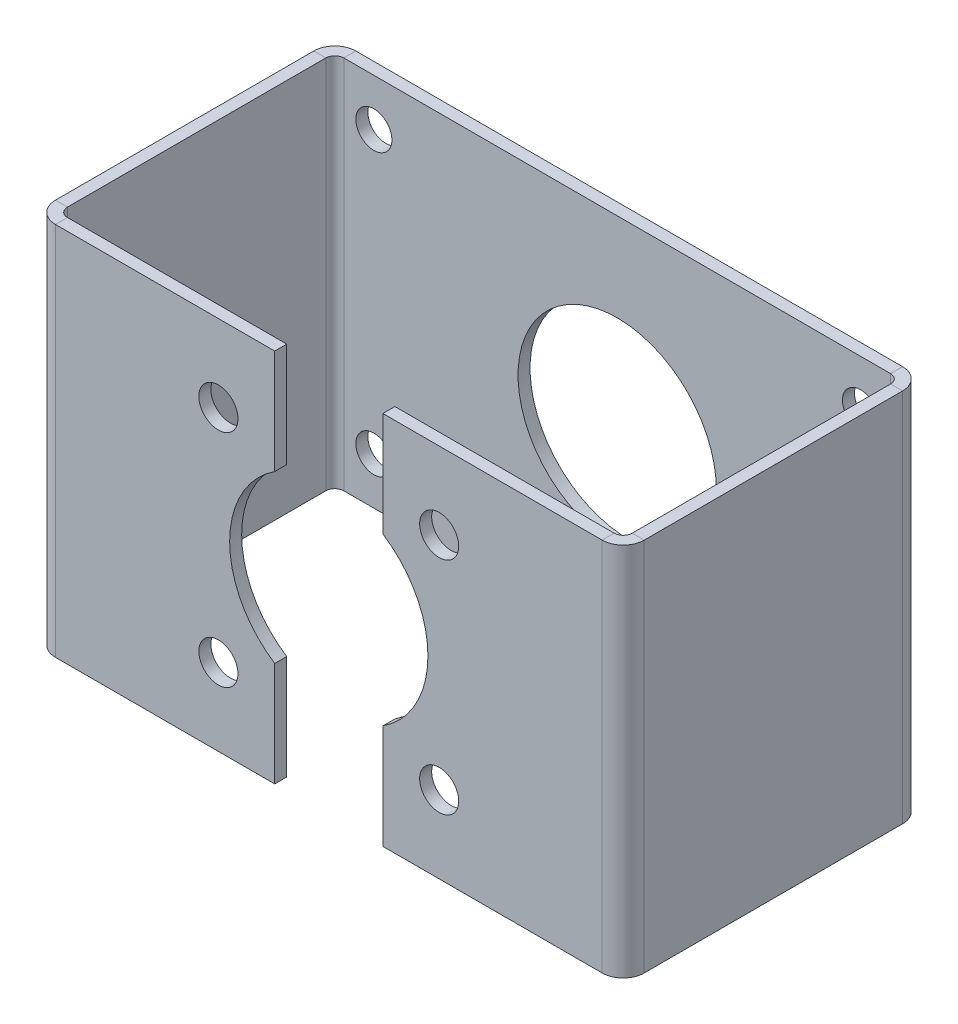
ISO-10303-21;
HEADER;
FILE_DESCRIPTION(('STEP AP214'),'2;1');
FILE_NAME('part.step','',(''),(''),'','','');
FILE_SCHEMA(('AUTOMOTIVE_DESIGN { 1 0 10303 214 1 1 1 1 }'));
ENDSEC;
DATA;
#1=APPLICATION_CONTEXT('core data for automotive mechanical design processes');
#2=APPLICATION_PROTOCOL_DEFINITION('international standard','automotive_design',2000,#1);
#3=PRODUCT_CONTEXT('',#1,'mechanical');
#4=PRODUCT('Part','Part','',(#3));
#5=PRODUCT_RELATED_PRODUCT_CATEGORY('part','',(#4));
#6=PRODUCT_DEFINITION_FORMATION('','',#4);
#7=PRODUCT_DEFINITION_CONTEXT('part definition',#1,'design');
#8=PRODUCT_DEFINITION('design','',#6,#7);
#9=PRODUCT_DEFINITION_SHAPE('','',#8);
#10=(LENGTH_UNIT() NAMED_UNIT(*) SI_UNIT(.MILLI.,.METRE.));
#11=(NAMED_UNIT(*) PLANE_ANGLE_UNIT() SI_UNIT($,.RADIAN.));
#12=(NAMED_UNIT(*) SI_UNIT($,.STERADIAN.) SOLID_ANGLE_UNIT());
#13=UNCERTAINTY_MEASURE_WITH_UNIT(LENGTH_MEASURE(1.E-05),#10,'distance_accuracy_value','');
#14=(GEOMETRIC_REPRESENTATION_CONTEXT(3) GLOBAL_UNCERTAINTY_ASSIGNED_CONTEXT((#13)) GLOBAL_UNIT_ASSIGNED_CONTEXT((#10,
#11,#12)) REPRESENTATION_CONTEXT('',''));
#15=CARTESIAN_POINT('',(0.,0.,0.));
#16=DIRECTION('',(0.,0.,1.));
#17=DIRECTION('',(1.,0.,0.));
#18=AXIS2_PLACEMENT_3D('',#15,#16,#17);
#19=CARTESIAN_POINT('',(-149.225000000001,-99.06,158.75));
#20=DIRECTION('',(0.,0.,1.));
#21=DIRECTION('',(1.,0.,0.));
#22=AXIS2_PLACEMENT_3D('',#19,#20,#21);
#23=PLANE('',#22);
#24=CARTESIAN_POINT('',(-58.3363094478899,58.3363094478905,158.750000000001));
#25=DIRECTION('',(0.,0.,1.));
#26=DIRECTION('',(1.,0.,0.));
#27=AXIS2_PLACEMENT_3D('',#24,#25,#26);
#28=CIRCLE('',#27,10.3251);
#29=CARTESIAN_POINT('',(-48.0112094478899,58.3363094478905,158.750000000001));
#30=VERTEX_POINT('',#29);
#31=EDGE_CURVE('E615',#30,#30,#28,.T.);
#32=ORIENTED_EDGE('',*,*,#31,.F.);
#33=EDGE_LOOP('',(#32));
#34=FACE_BOUND('',#33,.T.);
#35=CARTESIAN_POINT('',(-58.3363179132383,-58.3363009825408,158.750000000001));
#36=DIRECTION('',(0.,0.,1.));
#37=DIRECTION('',(1.,0.,0.));
#38=AXIS2_PLACEMENT_3D('',#35,#36,#37);
#39=CIRCLE('',#38,10.3251);
#40=CARTESIAN_POINT('',(-48.0112179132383,-58.3363009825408,158.750000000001));
#41=VERTEX_POINT('',#40);
#42=EDGE_CURVE('E633',#41,#41,#39,.T.);
#43=ORIENTED_EDGE('',*,*,#42,.F.);
#44=EDGE_LOOP('',(#43));
#45=FACE_BOUND('',#44,.T.);
#46=DIRECTION('',(0.,-1.,0.));
#47=VECTOR('',#46,1.);
#48=CARTESIAN_POINT('',(-28.5750000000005,-99.06,158.750000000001));
#49=LINE('',#48,#47);
#50=CARTESIAN_POINT('',(-28.5750000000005,-99.06,158.750000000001));
#51=VERTEX_POINT('',#50);
#52=CARTESIAN_POINT('',(-28.5750000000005,-43.908080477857,158.750000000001));
#53=VERTEX_POINT('',#52);
#54=EDGE_CURVE('E470',#51,#53,#49,.F.);
#55=ORIENTED_EDGE('',*,*,#54,.T.);
#56=CARTESIAN_POINT('',(0.,0.,158.750000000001));
#57=DIRECTION('',(0.,0.,1.));
#58=DIRECTION('',(1.,0.,0.));
#59=AXIS2_PLACEMENT_3D('',#56,#57,#58);
#60=CIRCLE('',#59,52.3875);
#61=CARTESIAN_POINT('',(-28.5750000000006,43.9080804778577,158.750000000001));
#62=VERTEX_POINT('',#61);
#63=EDGE_CURVE('E275',#62,#53,#60,.T.);
#64=ORIENTED_EDGE('',*,*,#63,.F.);
#65=CARTESIAN_POINT('',(-28.5750000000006,99.0600000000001,158.750000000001));
#66=VERTEX_POINT('',#65);
#67=EDGE_CURVE('E471',#62,#66,#49,.F.);
#68=ORIENTED_EDGE('',*,*,#67,.T.);
#69=DIRECTION('',(1.,0.,0.));
#70=VECTOR('',#69,1.);
#71=CARTESIAN_POINT('',(-149.225000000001,99.06,158.75));
#72=LINE('',#71,#70);
#73=CARTESIAN_POINT('',(-144.462500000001,99.06,158.75));
#74=VERTEX_POINT('',#73);
#75=EDGE_CURVE('E467',#66,#74,#72,.F.);
#76=ORIENTED_EDGE('',*,*,#75,.T.);
#77=DIRECTION('',(0.,-1.,0.));
#78=VECTOR('',#77,1.);
#79=CARTESIAN_POINT('',(-144.4625,-99.06,158.75));
#80=LINE('',#79,#78);
#81=CARTESIAN_POINT('',(-144.4625,-99.06,158.75));
#82=VERTEX_POINT('',#81);
#83=EDGE_CURVE('E304',#74,#82,#80,.T.);
#84=ORIENTED_EDGE('',*,*,#83,.T.);
#85=DIRECTION('',(-1.,0.,0.));
#86=VECTOR('',#85,1.);
#87=CARTESIAN_POINT('',(-149.225000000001,-99.06,158.75));
#88=LINE('',#87,#86);
#89=EDGE_CURVE('E298',#82,#51,#88,.F.);
#90=ORIENTED_EDGE('',*,*,#89,.T.);
#91=EDGE_LOOP('',(#55,#64,#68,#76,#84,#90));
#92=FACE_BOUND('',#91,.T.);
#93=ADVANCED_FACE('F112',(#34,#45,#92),#23,.T.);
#94=CARTESIAN_POINT('',(-149.225,-99.06,152.4));
#95=DIRECTION('',(0.,0.,1.));
#96=DIRECTION('',(1.,0.,0.));
#97=AXIS2_PLACEMENT_3D('',#94,#95,#96);
#98=PLANE('',#97);
#99=CARTESIAN_POINT('',(-58.3363094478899,58.3363094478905,152.400000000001));
#100=DIRECTION('',(0.,0.,1.));
#101=DIRECTION('',(1.,0.,0.));
#102=AXIS2_PLACEMENT_3D('',#99,#100,#101);
#103=CIRCLE('',#102,10.3251);
#104=CARTESIAN_POINT('',(-48.0112094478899,58.3363094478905,152.400000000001));
#105=VERTEX_POINT('',#104);
#106=EDGE_CURVE('E582',#105,#105,#103,.F.);
#107=ORIENTED_EDGE('',*,*,#106,.F.);
#108=EDGE_LOOP('',(#107));
#109=FACE_BOUND('',#108,.T.);
#110=CARTESIAN_POINT('',(-58.3363179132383,-58.3363009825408,152.400000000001));
#111=DIRECTION('',(0.,0.,1.));
#112=DIRECTION('',(1.,0.,0.));
#113=AXIS2_PLACEMENT_3D('',#110,#111,#112);
#114=CIRCLE('',#113,10.3251);
#115=CARTESIAN_POINT('',(-48.0112179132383,-58.3363009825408,152.400000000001));
#116=VERTEX_POINT('',#115);
#117=EDGE_CURVE('E630',#116,#116,#114,.F.);
#118=ORIENTED_EDGE('',*,*,#117,.F.);
#119=EDGE_LOOP('',(#118));
#120=FACE_BOUND('',#119,.T.);
#121=CARTESIAN_POINT('',(0.,0.,152.400000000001));
#122=DIRECTION('',(0.,0.,1.));
#123=DIRECTION('',(1.,0.,0.));
#124=AXIS2_PLACEMENT_3D('',#121,#122,#123);
#125=CIRCLE('',#124,52.3875);
#126=CARTESIAN_POINT('',(-28.5750000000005,43.9080804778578,152.400000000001));
#127=VERTEX_POINT('',#126);
#128=CARTESIAN_POINT('',(-28.5750000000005,-43.908080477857,152.400000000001));
#129=VERTEX_POINT('',#128);
#130=EDGE_CURVE('E129',#127,#129,#125,.T.);
#131=ORIENTED_EDGE('',*,*,#130,.T.);
#132=DIRECTION('',(0.,1.,0.));
#133=VECTOR('',#132,1.);
#134=CARTESIAN_POINT('',(-28.5750000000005,-99.06,152.400000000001));
#135=LINE('',#134,#133);
#136=CARTESIAN_POINT('',(-28.5750000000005,-99.06,152.400000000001));
#137=VERTEX_POINT('',#136);
#138=EDGE_CURVE('E287',#137,#129,#135,.T.);
#139=ORIENTED_EDGE('',*,*,#138,.F.);
#140=DIRECTION('',(1.,0.,0.));
#141=VECTOR('',#140,1.);
#142=CARTESIAN_POINT('',(-149.225,-99.06,152.4));
#143=LINE('',#142,#141);
#144=CARTESIAN_POINT('',(-144.462500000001,-99.06,152.4));
#145=VERTEX_POINT('',#144);
#146=EDGE_CURVE('E300',#145,#137,#143,.T.);
#147=ORIENTED_EDGE('',*,*,#146,.F.);
#148=DIRECTION('',(0.,1.,0.));
#149=VECTOR('',#148,1.);
#150=CARTESIAN_POINT('',(-144.462500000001,99.06,152.4));
#151=LINE('',#150,#149);
#152=CARTESIAN_POINT('',(-144.462500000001,99.06,152.4));
#153=VERTEX_POINT('',#152);
#154=EDGE_CURVE('E310',#153,#145,#151,.F.);
#155=ORIENTED_EDGE('',*,*,#154,.F.);
#156=DIRECTION('',(-1.,0.,0.));
#157=VECTOR('',#156,1.);
#158=CARTESIAN_POINT('',(-28.5750000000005,99.06,152.400000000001));
#159=LINE('',#158,#157);
#160=CARTESIAN_POINT('',(-28.5750000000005,99.06,152.400000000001));
#161=VERTEX_POINT('',#160);
#162=EDGE_CURVE('E295',#161,#153,#159,.T.);
#163=ORIENTED_EDGE('',*,*,#162,.F.);
#164=EDGE_CURVE('E289',#127,#161,#135,.T.);
#165=ORIENTED_EDGE('',*,*,#164,.F.);
#166=EDGE_LOOP('',(#131,#139,#147,#155,#163,#165));
#167=FACE_BOUND('',#166,.T.);
#168=ADVANCED_FACE('F285',(#109,#120,#167),#98,.F.);
#169=CARTESIAN_POINT('',(-28.5750000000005,-99.06,158.750000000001));
#170=DIRECTION('',(-1.,0.,0.));
#171=DIRECTION('',(0.,0.,1.));
#172=AXIS2_PLACEMENT_3D('',#169,#170,#171);
#173=PLANE('',#172);
#174=DIRECTION('',(0.,0.,1.));
#175=VECTOR('',#174,1.);
#176=CARTESIAN_POINT('',(-28.5750000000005,-43.908080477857,158.750000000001));
#177=LINE('',#176,#175);
#178=EDGE_CURVE('E272',#53,#129,#177,.F.);
#179=ORIENTED_EDGE('',*,*,#178,.F.);
#180=ORIENTED_EDGE('',*,*,#54,.F.);
#181=DIRECTION('',(0.,0.,-1.));
#182=VECTOR('',#181,1.);
#183=CARTESIAN_POINT('',(-28.5750000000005,-99.06,158.750000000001));
#184=LINE('',#183,#182);
#185=EDGE_CURVE('E294',#51,#137,#184,.T.);
#186=ORIENTED_EDGE('',*,*,#185,.T.);
#187=ORIENTED_EDGE('',*,*,#138,.T.);
#188=EDGE_LOOP('',(#179,#180,#186,#187));
#189=FACE_BOUND('',#188,.T.);
#190=ADVANCED_FACE('F292',(#189),#173,.F.);
#191=DIRECTION('',(0.,0.,1.));
#192=VECTOR('',#191,1.);
#193=CARTESIAN_POINT('',(-28.5750000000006,43.9080804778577,158.750000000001));
#194=LINE('',#193,#192);
#195=EDGE_CURVE('E280',#62,#127,#194,.F.);
#196=ORIENTED_EDGE('',*,*,#195,.T.);
#197=ORIENTED_EDGE('',*,*,#164,.T.);
#198=DIRECTION('',(0.,0.,-1.));
#199=VECTOR('',#198,1.);
#200=CARTESIAN_POINT('',(-28.5750000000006,99.06,158.750000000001));
#201=LINE('',#200,#199);
#202=EDGE_CURVE('E464',#66,#161,#201,.T.);
#203=ORIENTED_EDGE('',*,*,#202,.F.);
#204=ORIENTED_EDGE('',*,*,#67,.F.);
#205=EDGE_LOOP('',(#196,#197,#203,#204));
#206=FACE_BOUND('',#205,.T.);
#207=ADVANCED_FACE('F478',(#206),#173,.F.);
#208=CARTESIAN_POINT('',(149.225000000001,-99.06,158.75));
#209=DIRECTION('',(0.,0.,1.));
#210=DIRECTION('',(-1.,0.,0.));
#211=AXIS2_PLACEMENT_3D('',#208,#209,#210);
#212=PLANE('',#211);
#213=CARTESIAN_POINT('',(58.3363009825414,58.3363009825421,158.750000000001));
#214=DIRECTION('',(0.,0.,1.));
#215=DIRECTION('',(1.,0.,0.));
#216=AXIS2_PLACEMENT_3D('',#213,#214,#215);
#217=CIRCLE('',#216,10.3251);
#218=CARTESIAN_POINT('',(68.6614009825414,58.3363009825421,158.750000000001));
#219=VERTEX_POINT('',#218);
#220=EDGE_CURVE('E621',#219,#219,#217,.T.);
#221=ORIENTED_EDGE('',*,*,#220,.F.);
#222=EDGE_LOOP('',(#221));
#223=FACE_BOUND('',#222,.T.);
#224=CARTESIAN_POINT('',(58.3362925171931,-58.3363094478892,158.750000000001));
#225=DIRECTION('',(0.,0.,1.));
#226=DIRECTION('',(1.,0.,0.));
#227=AXIS2_PLACEMENT_3D('',#224,#225,#226);
#228=CIRCLE('',#227,10.3251);
#229=CARTESIAN_POINT('',(68.6613925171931,-58.3363094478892,158.750000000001));
#230=VERTEX_POINT('',#229);
#231=EDGE_CURVE('E627',#230,#230,#228,.T.);
#232=ORIENTED_EDGE('',*,*,#231,.F.);
#233=EDGE_LOOP('',(#232));
#234=FACE_BOUND('',#233,.T.);
#235=DIRECTION('',(0.,1.,0.));
#236=VECTOR('',#235,1.);
#237=CARTESIAN_POINT('',(28.5750000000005,-99.06,158.750000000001));
#238=LINE('',#237,#236);
#239=CARTESIAN_POINT('',(28.5750000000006,43.9080804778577,158.750000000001));
#240=VERTEX_POINT('',#239);
#241=CARTESIAN_POINT('',(28.5750000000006,99.06,158.750000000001));
#242=VERTEX_POINT('',#241);
#243=EDGE_CURVE('E602',#240,#242,#238,.T.);
#244=ORIENTED_EDGE('',*,*,#243,.F.);
#245=CARTESIAN_POINT('',(0.,0.,158.750000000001));
#246=DIRECTION('',(0.,0.,1.));
#247=DIRECTION('',(1.,0.,0.));
#248=AXIS2_PLACEMENT_3D('',#245,#246,#247);
#249=CIRCLE('',#248,52.3875);
#250=CARTESIAN_POINT('',(28.5750000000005,-43.908080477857,158.750000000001));
#251=VERTEX_POINT('',#250);
#252=EDGE_CURVE('E137',#251,#240,#249,.T.);
#253=ORIENTED_EDGE('',*,*,#252,.F.);
#254=CARTESIAN_POINT('',(28.5750000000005,-99.06,158.750000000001));
#255=VERTEX_POINT('',#254);
#256=EDGE_CURVE('E603',#255,#251,#238,.T.);
#257=ORIENTED_EDGE('',*,*,#256,.F.);
#258=DIRECTION('',(-1.,0.,0.));
#259=VECTOR('',#258,1.);
#260=CARTESIAN_POINT('',(149.225000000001,-99.06,158.75));
#261=LINE('',#260,#259);
#262=CARTESIAN_POINT('',(144.462500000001,-99.06,158.75));
#263=VERTEX_POINT('',#262);
#264=EDGE_CURVE('E606',#263,#255,#261,.T.);
#265=ORIENTED_EDGE('',*,*,#264,.F.);
#266=DIRECTION('',(0.,1.,0.));
#267=VECTOR('',#266,1.);
#268=CARTESIAN_POINT('',(144.4625,-99.06,158.75));
#269=LINE('',#268,#267);
#270=CARTESIAN_POINT('',(144.462500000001,99.06,158.75));
#271=VERTEX_POINT('',#270);
#272=EDGE_CURVE('E587',#263,#271,#269,.T.);
#273=ORIENTED_EDGE('',*,*,#272,.T.);
#274=DIRECTION('',(1.,0.,0.));
#275=VECTOR('',#274,1.);
#276=CARTESIAN_POINT('',(28.5750000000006,99.06,158.750000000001));
#277=LINE('',#276,#275);
#278=EDGE_CURVE('E599',#242,#271,#277,.T.);
#279=ORIENTED_EDGE('',*,*,#278,.F.);
#280=EDGE_LOOP('',(#244,#253,#257,#265,#273,#279));
#281=FACE_BOUND('',#280,.T.);
#282=ADVANCED_FACE('F672',(#223,#234,#281),#212,.T.);
#283=CARTESIAN_POINT('',(149.225,-99.06,152.4));
#284=DIRECTION('',(0.,0.,1.));
#285=DIRECTION('',(-1.,0.,0.));
#286=AXIS2_PLACEMENT_3D('',#283,#284,#285);
#287=PLANE('',#286);
#288=CARTESIAN_POINT('',(58.3363009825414,58.3363009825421,152.400000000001));
#289=DIRECTION('',(0.,0.,1.));
#290=DIRECTION('',(1.,0.,0.));
#291=AXIS2_PLACEMENT_3D('',#288,#289,#290);
#292=CIRCLE('',#291,10.3251);
#293=CARTESIAN_POINT('',(68.6614009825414,58.3363009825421,152.400000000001));
#294=VERTEX_POINT('',#293);
#295=EDGE_CURVE('E618',#294,#294,#292,.F.);
#296=ORIENTED_EDGE('',*,*,#295,.F.);
#297=EDGE_LOOP('',(#296));
#298=FACE_BOUND('',#297,.T.);
#299=CARTESIAN_POINT('',(58.3362925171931,-58.3363094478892,152.400000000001));
#300=DIRECTION('',(0.,0.,1.));
#301=DIRECTION('',(1.,0.,0.));
#302=AXIS2_PLACEMENT_3D('',#299,#300,#301);
#303=CIRCLE('',#302,10.3251);
#304=CARTESIAN_POINT('',(68.6613925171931,-58.3363094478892,152.400000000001));
#305=VERTEX_POINT('',#304);
#306=EDGE_CURVE('E624',#305,#305,#303,.F.);
#307=ORIENTED_EDGE('',*,*,#306,.F.);
#308=EDGE_LOOP('',(#307));
#309=FACE_BOUND('',#308,.T.);
#310=CARTESIAN_POINT('',(0.,0.,152.400000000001));
#311=DIRECTION('',(0.,0.,1.));
#312=DIRECTION('',(1.,0.,0.));
#313=AXIS2_PLACEMENT_3D('',#310,#311,#312);
#314=CIRCLE('',#313,52.3875);
#315=CARTESIAN_POINT('',(28.5750000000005,-43.908080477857,152.400000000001));
#316=VERTEX_POINT('',#315);
#317=CARTESIAN_POINT('',(28.5750000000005,43.9080804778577,152.400000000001));
#318=VERTEX_POINT('',#317);
#319=EDGE_CURVE('E640',#316,#318,#314,.T.);
#320=ORIENTED_EDGE('',*,*,#319,.T.);
#321=DIRECTION('',(0.,-1.,0.));
#322=VECTOR('',#321,1.);
#323=CARTESIAN_POINT('',(28.5750000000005,-99.06,152.400000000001));
#324=LINE('',#323,#322);
#325=CARTESIAN_POINT('',(28.5750000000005,99.0600000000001,152.400000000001));
#326=VERTEX_POINT('',#325);
#327=EDGE_CURVE('E593',#318,#326,#324,.F.);
#328=ORIENTED_EDGE('',*,*,#327,.T.);
#329=DIRECTION('',(-1.,0.,0.));
#330=VECTOR('',#329,1.);
#331=CARTESIAN_POINT('',(149.225000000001,99.06,152.4));
#332=LINE('',#331,#330);
#333=CARTESIAN_POINT('',(144.462500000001,99.06,152.4));
#334=VERTEX_POINT('',#333);
#335=EDGE_CURVE('E590',#326,#334,#332,.F.);
#336=ORIENTED_EDGE('',*,*,#335,.T.);
#337=DIRECTION('',(0.,-1.,0.));
#338=VECTOR('',#337,1.);
#339=CARTESIAN_POINT('',(144.4625,-99.06,152.4));
#340=LINE('',#339,#338);
#341=CARTESIAN_POINT('',(144.462500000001,-99.06,152.4));
#342=VERTEX_POINT('',#341);
#343=EDGE_CURVE('E581',#342,#334,#340,.F.);
#344=ORIENTED_EDGE('',*,*,#343,.F.);
#345=DIRECTION('',(1.,0.,0.));
#346=VECTOR('',#345,1.);
#347=CARTESIAN_POINT('',(149.225,-99.06,152.4));
#348=LINE('',#347,#346);
#349=CARTESIAN_POINT('',(28.5750000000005,-99.06,152.400000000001));
#350=VERTEX_POINT('',#349);
#351=EDGE_CURVE('E597',#342,#350,#348,.F.);
#352=ORIENTED_EDGE('',*,*,#351,.T.);
#353=EDGE_CURVE('E594',#350,#316,#324,.F.);
#354=ORIENTED_EDGE('',*,*,#353,.T.);
#355=EDGE_LOOP('',(#320,#328,#336,#344,#352,#354));
#356=FACE_BOUND('',#355,.T.);
#357=ADVANCED_FACE('F648',(#298,#309,#356),#287,.F.);
#358=CARTESIAN_POINT('',(28.5750000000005,-99.06,158.750000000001));
#359=DIRECTION('',(-1.,0.,0.));
#360=DIRECTION('',(0.,0.,1.));
#361=AXIS2_PLACEMENT_3D('',#358,#359,#360);
#362=PLANE('',#361);
#363=ORIENTED_EDGE('',*,*,#256,.T.);
#364=DIRECTION('',(0.,0.,1.));
#365=VECTOR('',#364,1.);
#366=CARTESIAN_POINT('',(28.5750000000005,-43.908080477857,158.750000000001));
#367=LINE('',#366,#365);
#368=EDGE_CURVE('E637',#251,#316,#367,.F.);
#369=ORIENTED_EDGE('',*,*,#368,.T.);
#370=ORIENTED_EDGE('',*,*,#353,.F.);
#371=DIRECTION('',(0.,0.,-1.));
#372=VECTOR('',#371,1.);
#373=CARTESIAN_POINT('',(28.5750000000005,-99.06,158.750000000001));
#374=LINE('',#373,#372);
#375=EDGE_CURVE('E608',#255,#350,#374,.T.);
#376=ORIENTED_EDGE('',*,*,#375,.F.);
#377=EDGE_LOOP('',(#363,#369,#370,#376));
#378=FACE_BOUND('',#377,.T.);
#379=ADVANCED_FACE('F669',(#378),#362,.T.);
#380=ORIENTED_EDGE('',*,*,#327,.F.);
#381=DIRECTION('',(0.,0.,1.));
#382=VECTOR('',#381,1.);
#383=CARTESIAN_POINT('',(28.5750000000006,43.9080804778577,158.750000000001));
#384=LINE('',#383,#382);
#385=EDGE_CURVE('E636',#240,#318,#384,.F.);
#386=ORIENTED_EDGE('',*,*,#385,.F.);
#387=ORIENTED_EDGE('',*,*,#243,.T.);
#388=DIRECTION('',(0.,0.,-1.));
#389=VECTOR('',#388,1.);
#390=CARTESIAN_POINT('',(28.5750000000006,99.06,158.750000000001));
#391=LINE('',#390,#389);
#392=EDGE_CURVE('E565',#242,#326,#391,.T.);
#393=ORIENTED_EDGE('',*,*,#392,.T.);
#394=EDGE_LOOP('',(#380,#386,#387,#393));
#395=FACE_BOUND('',#394,.T.);
#396=ADVANCED_FACE('F651',(#395),#362,.T.);
#397=CARTESIAN_POINT('',(155.575000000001,99.06,158.75));
#398=DIRECTION('',(0.,-1.,0.));
#399=DIRECTION('',(1.,0.,0.));
#400=AXIS2_PLACEMENT_3D('',#397,#398,#399);
#401=PLANE('',#400);
#402=DIRECTION('',(1.,0.,0.));
#403=VECTOR('',#402,1.);
#404=CARTESIAN_POINT('',(149.225,99.06,147.6375));
#405=LINE('',#404,#403);
#406=CARTESIAN_POINT('',(149.225,99.06,147.6375));
#407=VERTEX_POINT('',#406);
#408=CARTESIAN_POINT('',(155.575,99.06,147.6375));
#409=VERTEX_POINT('',#408);
#410=EDGE_CURVE('E555',#407,#409,#405,.T.);
#411=ORIENTED_EDGE('',*,*,#410,.T.);
#412=DIRECTION('',(0.,0.,-1.));
#413=VECTOR('',#412,1.);
#414=CARTESIAN_POINT('',(155.575,99.06,6.34999999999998));
#415=LINE('',#414,#413);
#416=CARTESIAN_POINT('',(155.575,99.06,11.1124999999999));
#417=VERTEX_POINT('',#416);
#418=EDGE_CURVE('E459',#417,#409,#415,.F.);
#419=ORIENTED_EDGE('',*,*,#418,.F.);
#420=DIRECTION('',(-1.,0.,0.));
#421=VECTOR('',#420,1.);
#422=CARTESIAN_POINT('',(149.225,99.06,11.1125));
#423=LINE('',#422,#421);
#424=CARTESIAN_POINT('',(149.225,99.06,11.1125));
#425=VERTEX_POINT('',#424);
#426=EDGE_CURVE('E541',#425,#417,#423,.F.);
#427=ORIENTED_EDGE('',*,*,#426,.F.);
#428=DIRECTION('',(0.,0.,1.));
#429=VECTOR('',#428,1.);
#430=CARTESIAN_POINT('',(149.225000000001,99.06,158.75));
#431=LINE('',#430,#429);
#432=EDGE_CURVE('E539',#425,#407,#431,.T.);
#433=ORIENTED_EDGE('',*,*,#432,.T.);
#434=EDGE_LOOP('',(#411,#419,#427,#433));
#435=FACE_BOUND('',#434,.T.);
#436=ADVANCED_FACE('F686',(#435),#401,.F.);
#437=CARTESIAN_POINT('',(155.575,-99.06,6.34999999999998));
#438=DIRECTION('',(0.,1.,0.));
#439=DIRECTION('',(-1.,0.,0.));
#440=AXIS2_PLACEMENT_3D('',#437,#438,#439);
#441=PLANE('',#440);
#442=DIRECTION('',(1.,0.,0.));
#443=VECTOR('',#442,1.);
#444=CARTESIAN_POINT('',(149.225,-99.06,147.6375));
#445=LINE('',#444,#443);
#446=CARTESIAN_POINT('',(149.225,-99.06,147.6375));
#447=VERTEX_POINT('',#446);
#448=CARTESIAN_POINT('',(155.575,-99.06,147.6375));
#449=VERTEX_POINT('',#448);
#450=EDGE_CURVE('E545',#447,#449,#445,.T.);
#451=ORIENTED_EDGE('',*,*,#450,.F.);
#452=DIRECTION('',(0.,0.,-1.));
#453=VECTOR('',#452,1.);
#454=CARTESIAN_POINT('',(149.225,-99.06,6.35));
#455=LINE('',#454,#453);
#456=CARTESIAN_POINT('',(149.225,-99.06,11.1125));
#457=VERTEX_POINT('',#456);
#458=EDGE_CURVE('E536',#447,#457,#455,.T.);
#459=ORIENTED_EDGE('',*,*,#458,.T.);
#460=DIRECTION('',(-1.,0.,0.));
#461=VECTOR('',#460,1.);
#462=CARTESIAN_POINT('',(155.575,-99.06,11.1124999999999));
#463=LINE('',#462,#461);
#464=CARTESIAN_POINT('',(155.575,-99.06,11.1124999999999));
#465=VERTEX_POINT('',#464);
#466=EDGE_CURVE('E449',#457,#465,#463,.F.);
#467=ORIENTED_EDGE('',*,*,#466,.T.);
#468=DIRECTION('',(0.,0.,1.));
#469=VECTOR('',#468,1.);
#470=CARTESIAN_POINT('',(155.575,-99.06,6.34999999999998));
#471=LINE('',#470,#469);
#472=EDGE_CURVE('E551',#449,#465,#471,.F.);
#473=ORIENTED_EDGE('',*,*,#472,.F.);
#474=EDGE_LOOP('',(#451,#459,#467,#473));
#475=FACE_BOUND('',#474,.T.);
#476=ADVANCED_FACE('F684',(#475),#441,.F.);
#477=CARTESIAN_POINT('',(155.575,-99.06,6.34999999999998));
#478=DIRECTION('',(1.,0.,0.));
#479=DIRECTION('',(0.,0.,1.));
#480=AXIS2_PLACEMENT_3D('',#477,#478,#479);
#481=PLANE('',#480);
#482=ORIENTED_EDGE('',*,*,#418,.T.);
#483=DIRECTION('',(0.,1.,0.));
#484=VECTOR('',#483,1.);
#485=CARTESIAN_POINT('',(155.575,99.06,147.6375));
#486=LINE('',#485,#484);
#487=EDGE_CURVE('E573',#409,#449,#486,.F.);
#488=ORIENTED_EDGE('',*,*,#487,.T.);
#489=ORIENTED_EDGE('',*,*,#472,.T.);
#490=DIRECTION('',(0.,1.,0.));
#491=VECTOR('',#490,1.);
#492=CARTESIAN_POINT('',(155.575,-99.06,11.1124999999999));
#493=LINE('',#492,#491);
#494=EDGE_CURVE('E543',#465,#417,#493,.T.);
#495=ORIENTED_EDGE('',*,*,#494,.T.);
#496=EDGE_LOOP('',(#482,#488,#489,#495));
#497=FACE_BOUND('',#496,.T.);
#498=ADVANCED_FACE('F681',(#497),#481,.T.);
#499=CARTESIAN_POINT('',(149.225,-99.06,6.35));
#500=DIRECTION('',(1.,0.,0.));
#501=DIRECTION('',(0.,0.,1.));
#502=AXIS2_PLACEMENT_3D('',#499,#500,#501);
#503=PLANE('',#502);
#504=DIRECTION('',(0.,1.,0.));
#505=VECTOR('',#504,1.);
#506=CARTESIAN_POINT('',(149.225,99.06,147.6375));
#507=LINE('',#506,#505);
#508=EDGE_CURVE('E564',#407,#447,#507,.F.);
#509=ORIENTED_EDGE('',*,*,#508,.F.);
#510=ORIENTED_EDGE('',*,*,#432,.F.);
#511=DIRECTION('',(0.,-1.,0.));
#512=VECTOR('',#511,1.);
#513=CARTESIAN_POINT('',(149.225,-99.06,11.1125));
#514=LINE('',#513,#512);
#515=EDGE_CURVE('E529',#457,#425,#514,.F.);
#516=ORIENTED_EDGE('',*,*,#515,.F.);
#517=ORIENTED_EDGE('',*,*,#458,.F.);
#518=EDGE_LOOP('',(#509,#510,#516,#517));
#519=FACE_BOUND('',#518,.T.);
#520=ADVANCED_FACE('F535',(#519),#503,.F.);
#521=CARTESIAN_POINT('',(155.575,-99.06,6.35));
#522=DIRECTION('',(0.,0.,-1.));
#523=DIRECTION('',(-1.,0.,0.));
#524=AXIS2_PLACEMENT_3D('',#521,#522,#523);
#525=PLANE('',#524);
#526=CARTESIAN_POINT('',(128.5875,74.2061,6.35));
#527=DIRECTION('',(0.,0.,1.));
#528=DIRECTION('',(1.,0.,0.));
#529=AXIS2_PLACEMENT_3D('',#526,#527,#528);
#530=CIRCLE('',#529,9.525);
#531=CARTESIAN_POINT('',(138.1125,74.2061,6.35));
#532=VERTEX_POINT('',#531);
#533=EDGE_CURVE('E392',#532,#532,#530,.T.);
#534=ORIENTED_EDGE('',*,*,#533,.F.);
#535=EDGE_LOOP('',(#534));
#536=FACE_BOUND('',#535,.T.);
#537=CARTESIAN_POINT('',(-128.5875,74.2061,6.35));
#538=DIRECTION('',(0.,0.,1.));
#539=DIRECTION('',(1.,0.,0.));
#540=AXIS2_PLACEMENT_3D('',#537,#538,#539);
#541=CIRCLE('',#540,9.52500000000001);
#542=CARTESIAN_POINT('',(-119.0625,74.2061,6.35));
#543=VERTEX_POINT('',#542);
#544=EDGE_CURVE('E404',#543,#543,#541,.T.);
#545=ORIENTED_EDGE('',*,*,#544,.F.);
#546=EDGE_LOOP('',(#545));
#547=FACE_BOUND('',#546,.T.);
#548=CARTESIAN_POINT('',(0.,0.,6.35));
#549=DIRECTION('',(0.,0.,1.));
#550=DIRECTION('',(1.,0.,0.));
#551=AXIS2_PLACEMENT_3D('',#548,#549,#550);
#552=CIRCLE('',#551,52.3875);
#553=CARTESIAN_POINT('',(52.3875,0.,6.35));
#554=VERTEX_POINT('',#553);
#555=EDGE_CURVE('E410',#554,#554,#552,.T.);
#556=ORIENTED_EDGE('',*,*,#555,.F.);
#557=EDGE_LOOP('',(#556));
#558=FACE_BOUND('',#557,.T.);
#559=CARTESIAN_POINT('',(-128.5875,-74.2061,6.35));
#560=DIRECTION('',(0.,0.,1.));
#561=DIRECTION('',(1.,0.,0.));
#562=AXIS2_PLACEMENT_3D('',#559,#560,#561);
#563=CIRCLE('',#562,9.52500000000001);
#564=CARTESIAN_POINT('',(-119.0625,-74.2061,6.35));
#565=VERTEX_POINT('',#564);
#566=EDGE_CURVE('E398',#565,#565,#563,.T.);
#567=ORIENTED_EDGE('',*,*,#566,.F.);
#568=EDGE_LOOP('',(#567));
#569=FACE_BOUND('',#568,.T.);
#570=CARTESIAN_POINT('',(128.5875,-74.2061,6.35));
#571=DIRECTION('',(0.,0.,1.));
#572=DIRECTION('',(1.,0.,0.));
#573=AXIS2_PLACEMENT_3D('',#570,#571,#572);
#574=CIRCLE('',#573,9.525);
#575=CARTESIAN_POINT('',(138.1125,-74.2061,6.35));
#576=VERTEX_POINT('',#575);
#577=EDGE_CURVE('E386',#576,#576,#574,.T.);
#578=ORIENTED_EDGE('',*,*,#577,.F.);
#579=EDGE_LOOP('',(#578));
#580=FACE_BOUND('',#579,.T.);
#581=DIRECTION('',(0.,1.,0.));
#582=VECTOR('',#581,1.);
#583=CARTESIAN_POINT('',(144.4625,99.06,6.35000000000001));
#584=LINE('',#583,#582);
#585=CARTESIAN_POINT('',(144.4625,99.06,6.35000000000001));
#586=VERTEX_POINT('',#585);
#587=CARTESIAN_POINT('',(144.4625,-99.06,6.35000000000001));
#588=VERTEX_POINT('',#587);
#589=EDGE_CURVE('E454',#586,#588,#584,.F.);
#590=ORIENTED_EDGE('',*,*,#589,.F.);
#591=DIRECTION('',(-1.,0.,0.));
#592=VECTOR('',#591,1.);
#593=CARTESIAN_POINT('',(-155.575,99.06,6.35));
#594=LINE('',#593,#592);
#595=CARTESIAN_POINT('',(-144.4625,99.06,6.34999999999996));
#596=VERTEX_POINT('',#595);
#597=EDGE_CURVE('E13',#586,#596,#594,.T.);
#598=ORIENTED_EDGE('',*,*,#597,.T.);
#599=DIRECTION('',(0.,-1.,0.));
#600=VECTOR('',#599,1.);
#601=CARTESIAN_POINT('',(-144.4625,-99.06,6.34999999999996));
#602=LINE('',#601,#600);
#603=CARTESIAN_POINT('',(-144.4625,-99.06,6.34999999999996));
#604=VERTEX_POINT('',#603);
#605=EDGE_CURVE('E375',#604,#596,#602,.F.);
#606=ORIENTED_EDGE('',*,*,#605,.F.);
#607=DIRECTION('',(1.,0.,0.));
#608=VECTOR('',#607,1.);
#609=CARTESIAN_POINT('',(-155.575,-99.06,6.35));
#610=LINE('',#609,#608);
#611=EDGE_CURVE('E121',#604,#588,#610,.T.);
#612=ORIENTED_EDGE('',*,*,#611,.T.);
#613=EDGE_LOOP('',(#590,#598,#606,#612));
#614=FACE_BOUND('',#613,.T.);
#615=ADVANCED_FACE('F520',(#536,#547,#558,#569,#580,#614),#525,.F.);
#616=CARTESIAN_POINT('',(155.575,-99.06,0.));
#617=DIRECTION('',(0.,0.,-1.));
#618=DIRECTION('',(-1.,0.,0.));
#619=AXIS2_PLACEMENT_3D('',#616,#617,#618);
#620=PLANE('',#619);
#621=CARTESIAN_POINT('',(128.5875,74.2061,0.));
#622=DIRECTION('',(0.,0.,1.));
#623=DIRECTION('',(1.,0.,0.));
#624=AXIS2_PLACEMENT_3D('',#621,#622,#623);
#625=CIRCLE('',#624,9.525);
#626=CARTESIAN_POINT('',(138.1125,74.2061,0.));
#627=VERTEX_POINT('',#626);
#628=EDGE_CURVE('E389',#627,#627,#625,.T.);
#629=ORIENTED_EDGE('',*,*,#628,.T.);
#630=EDGE_LOOP('',(#629));
#631=FACE_BOUND('',#630,.T.);
#632=CARTESIAN_POINT('',(-128.5875,74.2061,0.));
#633=DIRECTION('',(0.,0.,1.));
#634=DIRECTION('',(1.,0.,0.));
#635=AXIS2_PLACEMENT_3D('',#632,#633,#634);
#636=CIRCLE('',#635,9.52500000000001);
#637=CARTESIAN_POINT('',(-119.0625,74.2061,0.));
#638=VERTEX_POINT('',#637);
#639=EDGE_CURVE('E401',#638,#638,#636,.T.);
#640=ORIENTED_EDGE('',*,*,#639,.T.);
#641=EDGE_LOOP('',(#640));
#642=FACE_BOUND('',#641,.T.);
#643=CARTESIAN_POINT('',(0.,0.,0.));
#644=DIRECTION('',(0.,0.,1.));
#645=DIRECTION('',(1.,0.,0.));
#646=AXIS2_PLACEMENT_3D('',#643,#644,#645);
#647=CIRCLE('',#646,52.3875);
#648=CARTESIAN_POINT('',(52.3875,0.,0.));
#649=VERTEX_POINT('',#648);
#650=EDGE_CURVE('E407',#649,#649,#647,.T.);
#651=ORIENTED_EDGE('',*,*,#650,.T.);
#652=EDGE_LOOP('',(#651));
#653=FACE_BOUND('',#652,.T.);
#654=CARTESIAN_POINT('',(-128.5875,-74.2061,0.));
#655=DIRECTION('',(0.,0.,1.));
#656=DIRECTION('',(1.,0.,0.));
#657=AXIS2_PLACEMENT_3D('',#654,#655,#656);
#658=CIRCLE('',#657,9.52500000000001);
#659=CARTESIAN_POINT('',(-119.0625,-74.2061,0.));
#660=VERTEX_POINT('',#659);
#661=EDGE_CURVE('E395',#660,#660,#658,.T.);
#662=ORIENTED_EDGE('',*,*,#661,.T.);
#663=EDGE_LOOP('',(#662));
#664=FACE_BOUND('',#663,.T.);
#665=CARTESIAN_POINT('',(128.5875,-74.2061,0.));
#666=DIRECTION('',(0.,0.,1.));
#667=DIRECTION('',(1.,0.,0.));
#668=AXIS2_PLACEMENT_3D('',#665,#666,#667);
#669=CIRCLE('',#668,9.525);
#670=CARTESIAN_POINT('',(138.1125,-74.2061,0.));
#671=VERTEX_POINT('',#670);
#672=EDGE_CURVE('E383',#671,#671,#669,.T.);
#673=ORIENTED_EDGE('',*,*,#672,.T.);
#674=EDGE_LOOP('',(#673));
#675=FACE_BOUND('',#674,.T.);
#676=DIRECTION('',(-1.,0.,0.));
#677=VECTOR('',#676,1.);
#678=CARTESIAN_POINT('',(-155.575,99.06,0.));
#679=LINE('',#678,#677);
#680=CARTESIAN_POINT('',(144.4625,99.06,0.));
#681=VERTEX_POINT('',#680);
#682=CARTESIAN_POINT('',(-144.4625,99.06,0.));
#683=VERTEX_POINT('',#682);
#684=EDGE_CURVE('E116',#681,#683,#679,.T.);
#685=ORIENTED_EDGE('',*,*,#684,.F.);
#686=DIRECTION('',(0.,1.,0.));
#687=VECTOR('',#686,1.);
#688=CARTESIAN_POINT('',(144.4625,99.06,0.));
#689=LINE('',#688,#687);
#690=CARTESIAN_POINT('',(144.4625,-99.06,0.));
#691=VERTEX_POINT('',#690);
#692=EDGE_CURVE('E438',#681,#691,#689,.F.);
#693=ORIENTED_EDGE('',*,*,#692,.T.);
#694=DIRECTION('',(1.,0.,0.));
#695=VECTOR('',#694,1.);
#696=CARTESIAN_POINT('',(-155.575,-99.06,0.));
#697=LINE('',#696,#695);
#698=CARTESIAN_POINT('',(-144.4625,-99.06,0.));
#699=VERTEX_POINT('',#698);
#700=EDGE_CURVE('E413',#699,#691,#697,.T.);
#701=ORIENTED_EDGE('',*,*,#700,.F.);
#702=DIRECTION('',(0.,-1.,0.));
#703=VECTOR('',#702,1.);
#704=CARTESIAN_POINT('',(-144.4625,-99.06,0.));
#705=LINE('',#704,#703);
#706=EDGE_CURVE('E362',#699,#683,#705,.F.);
#707=ORIENTED_EDGE('',*,*,#706,.T.);
#708=EDGE_LOOP('',(#685,#693,#701,#707));
#709=FACE_BOUND('',#708,.T.);
#710=ADVANCED_FACE('F437',(#631,#642,#653,#664,#675,#709),#620,.T.);
#711=CARTESIAN_POINT('',(-155.575,-99.06,6.35));
#712=DIRECTION('',(0.,1.,0.));
#713=DIRECTION('',(-1.,0.,0.));
#714=AXIS2_PLACEMENT_3D('',#711,#712,#713);
#715=PLANE('',#714);
#716=DIRECTION('',(0.,0.,-1.));
#717=VECTOR('',#716,1.);
#718=CARTESIAN_POINT('',(144.4625,-99.06,6.35000000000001));
#719=LINE('',#718,#717);
#720=EDGE_CURVE('E315',#588,#691,#719,.T.);
#721=ORIENTED_EDGE('',*,*,#720,.F.);
#722=ORIENTED_EDGE('',*,*,#611,.F.);
#723=DIRECTION('',(0.,0.,-1.));
#724=VECTOR('',#723,1.);
#725=CARTESIAN_POINT('',(-144.4625,-99.06,6.34999999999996));
#726=LINE('',#725,#724);
#727=EDGE_CURVE('E369',#604,#699,#726,.T.);
#728=ORIENTED_EDGE('',*,*,#727,.T.);
#729=ORIENTED_EDGE('',*,*,#700,.T.);
#730=EDGE_LOOP('',(#721,#722,#728,#729));
#731=FACE_BOUND('',#730,.T.);
#732=ADVANCED_FACE('F114',(#731),#715,.F.);
#733=CARTESIAN_POINT('',(-155.575,99.06,6.35));
#734=DIRECTION('',(0.,-1.,0.));
#735=DIRECTION('',(1.,0.,0.));
#736=AXIS2_PLACEMENT_3D('',#733,#734,#735);
#737=PLANE('',#736);
#738=DIRECTION('',(0.,0.,-1.));
#739=VECTOR('',#738,1.);
#740=CARTESIAN_POINT('',(144.4625,99.06,6.35000000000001));
#741=LINE('',#740,#739);
#742=EDGE_CURVE('E428',#586,#681,#741,.T.);
#743=ORIENTED_EDGE('',*,*,#742,.T.);
#744=ORIENTED_EDGE('',*,*,#684,.T.);
#745=DIRECTION('',(0.,0.,-1.));
#746=VECTOR('',#745,1.);
#747=CARTESIAN_POINT('',(-144.4625,99.06,6.34999999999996));
#748=LINE('',#747,#746);
#749=EDGE_CURVE('E380',#596,#683,#748,.T.);
#750=ORIENTED_EDGE('',*,*,#749,.F.);
#751=ORIENTED_EDGE('',*,*,#597,.F.);
#752=EDGE_LOOP('',(#743,#744,#750,#751));
#753=FACE_BOUND('',#752,.T.);
#754=ADVANCED_FACE('F426',(#753),#737,.F.);
#755=CARTESIAN_POINT('',(-155.575,-99.06,6.34999999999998));
#756=DIRECTION('',(0.,-1.,0.));
#757=DIRECTION('',(1.,0.,0.));
#758=AXIS2_PLACEMENT_3D('',#755,#756,#757);
#759=PLANE('',#758);
#760=DIRECTION('',(0.,0.,1.));
#761=VECTOR('',#760,1.);
#762=CARTESIAN_POINT('',(-149.225,-99.06,6.35));
#763=LINE('',#762,#761);
#764=CARTESIAN_POINT('',(-149.225,-99.06,147.6375));
#765=VERTEX_POINT('',#764);
#766=CARTESIAN_POINT('',(-149.225,-99.06,11.1125));
#767=VERTEX_POINT('',#766);
#768=EDGE_CURVE('E346',#765,#767,#763,.F.);
#769=ORIENTED_EDGE('',*,*,#768,.F.);
#770=DIRECTION('',(-1.,0.,0.));
#771=VECTOR('',#770,1.);
#772=CARTESIAN_POINT('',(-149.225,-99.06,147.6375));
#773=LINE('',#772,#771);
#774=CARTESIAN_POINT('',(-155.575,-99.06,147.6375));
#775=VERTEX_POINT('',#774);
#776=EDGE_CURVE('E323',#765,#775,#773,.T.);
#777=ORIENTED_EDGE('',*,*,#776,.T.);
#778=DIRECTION('',(0.,0.,-1.));
#779=VECTOR('',#778,1.);
#780=CARTESIAN_POINT('',(-155.575,-99.06,6.34999999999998));
#781=LINE('',#780,#779);
#782=CARTESIAN_POINT('',(-155.575,-99.06,11.1124999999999));
#783=VERTEX_POINT('',#782);
#784=EDGE_CURVE('E340',#775,#783,#781,.T.);
#785=ORIENTED_EDGE('',*,*,#784,.T.);
#786=DIRECTION('',(-1.,0.,0.));
#787=VECTOR('',#786,1.);
#788=CARTESIAN_POINT('',(-149.225,-99.06,11.1125));
#789=LINE('',#788,#787);
#790=EDGE_CURVE('E354',#767,#783,#789,.T.);
#791=ORIENTED_EDGE('',*,*,#790,.F.);
#792=EDGE_LOOP('',(#769,#777,#785,#791));
#793=FACE_BOUND('',#792,.T.);
#794=ADVANCED_FACE('F514',(#793),#759,.T.);
#795=CARTESIAN_POINT('',(-155.575,-99.06,6.34999999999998));
#796=DIRECTION('',(-1.,0.,0.));
#797=DIRECTION('',(0.,0.,1.));
#798=AXIS2_PLACEMENT_3D('',#795,#796,#797);
#799=PLANE('',#798);
#800=ORIENTED_EDGE('',*,*,#784,.F.);
#801=DIRECTION('',(0.,-1.,0.));
#802=VECTOR('',#801,1.);
#803=CARTESIAN_POINT('',(-155.575,-99.06,147.6375));
#804=LINE('',#803,#802);
#805=CARTESIAN_POINT('',(-155.575000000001,99.06,147.6375));
#806=VERTEX_POINT('',#805);
#807=EDGE_CURVE('E316',#775,#806,#804,.F.);
#808=ORIENTED_EDGE('',*,*,#807,.T.);
#809=DIRECTION('',(0.,0.,1.));
#810=VECTOR('',#809,1.);
#811=CARTESIAN_POINT('',(-155.575000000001,99.06,158.75));
#812=LINE('',#811,#810);
#813=CARTESIAN_POINT('',(-155.575,99.06,11.1124999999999));
#814=VERTEX_POINT('',#813);
#815=EDGE_CURVE('E343',#814,#806,#812,.T.);
#816=ORIENTED_EDGE('',*,*,#815,.F.);
#817=DIRECTION('',(0.,-1.,0.));
#818=VECTOR('',#817,1.);
#819=CARTESIAN_POINT('',(-155.575,-99.06,11.1124999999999));
#820=LINE('',#819,#818);
#821=EDGE_CURVE('E351',#814,#783,#820,.T.);
#822=ORIENTED_EDGE('',*,*,#821,.T.);
#823=EDGE_LOOP('',(#800,#808,#816,#822));
#824=FACE_BOUND('',#823,.T.);
#825=ADVANCED_FACE('F499',(#824),#799,.T.);
#826=CARTESIAN_POINT('',(-149.225,-99.06,6.35));
#827=DIRECTION('',(-1.,0.,0.));
#828=DIRECTION('',(0.,0.,1.));
#829=AXIS2_PLACEMENT_3D('',#826,#827,#828);
#830=PLANE('',#829);
#831=DIRECTION('',(0.,-1.,0.));
#832=VECTOR('',#831,1.);
#833=CARTESIAN_POINT('',(-149.225,-99.06,147.6375));
#834=LINE('',#833,#832);
#835=CARTESIAN_POINT('',(-149.225,99.06,147.6375));
#836=VERTEX_POINT('',#835);
#837=EDGE_CURVE('E329',#765,#836,#834,.F.);
#838=ORIENTED_EDGE('',*,*,#837,.F.);
#839=ORIENTED_EDGE('',*,*,#768,.T.);
#840=DIRECTION('',(0.,1.,0.));
#841=VECTOR('',#840,1.);
#842=CARTESIAN_POINT('',(-149.225,99.06,11.1125));
#843=LINE('',#842,#841);
#844=CARTESIAN_POINT('',(-149.225,99.06,11.1125));
#845=VERTEX_POINT('',#844);
#846=EDGE_CURVE('E357',#845,#767,#843,.F.);
#847=ORIENTED_EDGE('',*,*,#846,.F.);
#848=DIRECTION('',(0.,0.,-1.));
#849=VECTOR('',#848,1.);
#850=CARTESIAN_POINT('',(-149.225,99.06,6.35));
#851=LINE('',#850,#849);
#852=EDGE_CURVE('E348',#845,#836,#851,.F.);
#853=ORIENTED_EDGE('',*,*,#852,.T.);
#854=EDGE_LOOP('',(#838,#839,#847,#853));
#855=FACE_BOUND('',#854,.T.);
#856=ADVANCED_FACE('F510',(#855),#830,.F.);
#857=CARTESIAN_POINT('',(0.,0.,6.35));
#858=DIRECTION('',(0.,0.,-1.));
#859=DIRECTION('',(-1.,0.,0.));
#860=AXIS2_PLACEMENT_3D('',#857,#858,#859);
#861=CYLINDRICAL_SURFACE('',#860,52.3875);
#862=ORIENTED_EDGE('',*,*,#555,.T.);
#863=EDGE_LOOP('',(#862));
#864=FACE_BOUND('',#863,.T.);
#865=ORIENTED_EDGE('',*,*,#650,.F.);
#866=EDGE_LOOP('',(#865));
#867=FACE_BOUND('',#866,.T.);
#868=ADVANCED_FACE('F728',(#864,#867),#861,.F.);
#869=CARTESIAN_POINT('',(-128.5875,74.2061,6.35));
#870=DIRECTION('',(0.,0.,-1.));
#871=DIRECTION('',(-1.,0.,0.));
#872=AXIS2_PLACEMENT_3D('',#869,#870,#871);
#873=CYLINDRICAL_SURFACE('',#872,9.52500000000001);
#874=ORIENTED_EDGE('',*,*,#544,.T.);
#875=EDGE_LOOP('',(#874));
#876=FACE_BOUND('',#875,.T.);
#877=ORIENTED_EDGE('',*,*,#639,.F.);
#878=EDGE_LOOP('',(#877));
#879=FACE_BOUND('',#878,.T.);
#880=ADVANCED_FACE('F752',(#876,#879),#873,.F.);
#881=CARTESIAN_POINT('',(-128.5875,-74.2061,6.35));
#882=DIRECTION('',(0.,0.,-1.));
#883=DIRECTION('',(-1.,0.,0.));
#884=AXIS2_PLACEMENT_3D('',#881,#882,#883);
#885=CYLINDRICAL_SURFACE('',#884,9.52500000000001);
#886=ORIENTED_EDGE('',*,*,#566,.T.);
#887=EDGE_LOOP('',(#886));
#888=FACE_BOUND('',#887,.T.);
#889=ORIENTED_EDGE('',*,*,#661,.F.);
#890=EDGE_LOOP('',(#889));
#891=FACE_BOUND('',#890,.T.);
#892=ADVANCED_FACE('F748',(#888,#891),#885,.F.);
#893=CARTESIAN_POINT('',(128.5875,74.2061,6.35));
#894=DIRECTION('',(0.,0.,-1.));
#895=DIRECTION('',(-1.,0.,0.));
#896=AXIS2_PLACEMENT_3D('',#893,#894,#895);
#897=CYLINDRICAL_SURFACE('',#896,9.525);
#898=ORIENTED_EDGE('',*,*,#533,.T.);
#899=EDGE_LOOP('',(#898));
#900=FACE_BOUND('',#899,.T.);
#901=ORIENTED_EDGE('',*,*,#628,.F.);
#902=EDGE_LOOP('',(#901));
#903=FACE_BOUND('',#902,.T.);
#904=ADVANCED_FACE('F744',(#900,#903),#897,.F.);
#905=CARTESIAN_POINT('',(128.5875,-74.2061,6.35));
#906=DIRECTION('',(0.,0.,-1.));
#907=DIRECTION('',(-1.,0.,0.));
#908=AXIS2_PLACEMENT_3D('',#905,#906,#907);
#909=CYLINDRICAL_SURFACE('',#908,9.525);
#910=ORIENTED_EDGE('',*,*,#577,.T.);
#911=EDGE_LOOP('',(#910));
#912=FACE_BOUND('',#911,.T.);
#913=ORIENTED_EDGE('',*,*,#672,.F.);
#914=EDGE_LOOP('',(#913));
#915=FACE_BOUND('',#914,.T.);
#916=ADVANCED_FACE('F739',(#912,#915),#909,.F.);
#917=CARTESIAN_POINT('',(-144.4625,99.06,11.1125));
#918=DIRECTION('',(0.,1.,0.));
#919=DIRECTION('',(0.,0.,1.));
#920=AXIS2_PLACEMENT_3D('',#917,#918,#919);
#921=PLANE('',#920);
#922=DIRECTION('',(-1.,0.,0.));
#923=VECTOR('',#922,1.);
#924=CARTESIAN_POINT('',(-155.575,99.06,11.1124999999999));
#925=LINE('',#924,#923);
#926=EDGE_CURVE('E337',#845,#814,#925,.T.);
#927=ORIENTED_EDGE('',*,*,#926,.F.);
#928=CARTESIAN_POINT('',(-144.4625,99.06,11.1125));
#929=DIRECTION('',(0.,-1.,0.));
#930=DIRECTION('',(0.,0.,-1.));
#931=AXIS2_PLACEMENT_3D('',#928,#929,#930);
#932=CIRCLE('',#931,4.76250000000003);
#933=EDGE_CURVE('E372',#596,#845,#932,.F.);
#934=ORIENTED_EDGE('',*,*,#933,.F.);
#935=ORIENTED_EDGE('',*,*,#749,.T.);
#936=CARTESIAN_POINT('',(-144.4625,99.06,11.1125));
#937=DIRECTION('',(0.,-1.,0.));
#938=DIRECTION('',(0.,0.,-1.));
#939=AXIS2_PLACEMENT_3D('',#936,#937,#938);
#940=CIRCLE('',#939,11.1125);
#941=EDGE_CURVE('E365',#683,#814,#940,.F.);
#942=ORIENTED_EDGE('',*,*,#941,.T.);
#943=EDGE_LOOP('',(#927,#934,#935,#942));
#944=FACE_BOUND('',#943,.T.);
#945=ADVANCED_FACE('F436',(#944),#921,.T.);
#946=CARTESIAN_POINT('',(-144.4625,-99.06,11.1125));
#947=DIRECTION('',(0.,1.,0.));
#948=DIRECTION('',(0.,0.,1.));
#949=AXIS2_PLACEMENT_3D('',#946,#947,#948);
#950=PLANE('',#949);
#951=CARTESIAN_POINT('',(-144.4625,-99.06,11.1125));
#952=DIRECTION('',(0.,-1.,0.));
#953=DIRECTION('',(0.,0.,-1.));
#954=AXIS2_PLACEMENT_3D('',#951,#952,#953);
#955=CIRCLE('',#954,4.76250000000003);
#956=EDGE_CURVE('E342',#767,#604,#955,.T.);
#957=ORIENTED_EDGE('',*,*,#956,.F.);
#958=ORIENTED_EDGE('',*,*,#790,.T.);
#959=CARTESIAN_POINT('',(-144.4625,-99.06,11.1125));
#960=DIRECTION('',(0.,-1.,0.));
#961=DIRECTION('',(0.,0.,-1.));
#962=AXIS2_PLACEMENT_3D('',#959,#960,#961);
#963=CIRCLE('',#962,11.1125);
#964=EDGE_CURVE('E366',#783,#699,#963,.T.);
#965=ORIENTED_EDGE('',*,*,#964,.T.);
#966=ORIENTED_EDGE('',*,*,#727,.F.);
#967=EDGE_LOOP('',(#957,#958,#965,#966));
#968=FACE_BOUND('',#967,.T.);
#969=ADVANCED_FACE('F516',(#968),#950,.F.);
#970=CARTESIAN_POINT('',(-144.4625,-99.06,11.1125));
#971=DIRECTION('',(0.,-1.,0.));
#972=DIRECTION('',(-1.,0.,0.));
#973=AXIS2_PLACEMENT_3D('',#970,#971,#972);
#974=CYLINDRICAL_SURFACE('',#973,11.1125);
#975=ORIENTED_EDGE('',*,*,#706,.F.);
#976=ORIENTED_EDGE('',*,*,#964,.F.);
#977=ORIENTED_EDGE('',*,*,#821,.F.);
#978=ORIENTED_EDGE('',*,*,#941,.F.);
#979=EDGE_LOOP('',(#975,#976,#977,#978));
#980=FACE_BOUND('',#979,.T.);
#981=ADVANCED_FACE('F432',(#980),#974,.T.);
#982=CARTESIAN_POINT('',(-144.4625,-99.06,11.1125));
#983=DIRECTION('',(0.,-1.,0.));
#984=DIRECTION('',(-1.,0.,0.));
#985=AXIS2_PLACEMENT_3D('',#982,#983,#984);
#986=CYLINDRICAL_SURFACE('',#985,4.76250000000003);
#987=ORIENTED_EDGE('',*,*,#605,.T.);
#988=ORIENTED_EDGE('',*,*,#933,.T.);
#989=ORIENTED_EDGE('',*,*,#846,.T.);
#990=ORIENTED_EDGE('',*,*,#956,.T.);
#991=EDGE_LOOP('',(#987,#988,#989,#990));
#992=FACE_BOUND('',#991,.T.);
#993=ADVANCED_FACE('F506',(#992),#986,.F.);
#994=CARTESIAN_POINT('',(-155.575000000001,99.06,158.75));
#995=DIRECTION('',(0.,1.,0.));
#996=DIRECTION('',(-1.,0.,0.));
#997=AXIS2_PLACEMENT_3D('',#994,#995,#996);
#998=PLANE('',#997);
#999=DIRECTION('',(-1.,0.,0.));
#1000=VECTOR('',#999,1.);
#1001=CARTESIAN_POINT('',(-149.225,99.06,147.6375));
#1002=LINE('',#1001,#1000);
#1003=EDGE_CURVE('E334',#836,#806,#1002,.T.);
#1004=ORIENTED_EDGE('',*,*,#1003,.F.);
#1005=ORIENTED_EDGE('',*,*,#852,.F.);
#1006=ORIENTED_EDGE('',*,*,#926,.T.);
#1007=ORIENTED_EDGE('',*,*,#815,.T.);
#1008=EDGE_LOOP('',(#1004,#1005,#1006,#1007));
#1009=FACE_BOUND('',#1008,.T.);
#1010=ADVANCED_FACE('F502',(#1009),#998,.T.);
#1011=CARTESIAN_POINT('',(-144.4625,99.06,147.6375));
#1012=DIRECTION('',(0.,1.,0.));
#1013=DIRECTION('',(0.,0.,1.));
#1014=AXIS2_PLACEMENT_3D('',#1011,#1012,#1013);
#1015=PLANE('',#1014);
#1016=DIRECTION('',(0.,0.,-1.));
#1017=VECTOR('',#1016,1.);
#1018=CARTESIAN_POINT('',(-144.462500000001,99.06,158.750000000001));
#1019=LINE('',#1018,#1017);
#1020=EDGE_CURVE('E312',#153,#74,#1019,.F.);
#1021=ORIENTED_EDGE('',*,*,#1020,.F.);
#1022=CARTESIAN_POINT('',(-144.4625,99.06,147.6375));
#1023=DIRECTION('',(0.,-1.,0.));
#1024=DIRECTION('',(0.,0.,-1.));
#1025=AXIS2_PLACEMENT_3D('',#1022,#1023,#1024);
#1026=CIRCLE('',#1025,4.76249999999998);
#1027=EDGE_CURVE('E326',#836,#153,#1026,.F.);
#1028=ORIENTED_EDGE('',*,*,#1027,.F.);
#1029=ORIENTED_EDGE('',*,*,#1003,.T.);
#1030=CARTESIAN_POINT('',(-144.4625,99.06,147.6375));
#1031=DIRECTION('',(0.,-1.,0.));
#1032=DIRECTION('',(0.,0.,-1.));
#1033=AXIS2_PLACEMENT_3D('',#1030,#1031,#1032);
#1034=CIRCLE('',#1033,11.1125);
#1035=EDGE_CURVE('E319',#806,#74,#1034,.F.);
#1036=ORIENTED_EDGE('',*,*,#1035,.T.);
#1037=EDGE_LOOP('',(#1021,#1028,#1029,#1036));
#1038=FACE_BOUND('',#1037,.T.);
#1039=ADVANCED_FACE('F483',(#1038),#1015,.T.);
#1040=CARTESIAN_POINT('',(-144.4625,-99.06,147.6375));
#1041=DIRECTION('',(0.,1.,0.));
#1042=DIRECTION('',(0.,0.,1.));
#1043=AXIS2_PLACEMENT_3D('',#1040,#1041,#1042);
#1044=PLANE('',#1043);
#1045=CARTESIAN_POINT('',(-144.4625,-99.06,147.6375));
#1046=DIRECTION('',(0.,-1.,0.));
#1047=DIRECTION('',(0.,0.,-1.));
#1048=AXIS2_PLACEMENT_3D('',#1045,#1046,#1047);
#1049=CIRCLE('',#1048,4.76249999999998);
#1050=EDGE_CURVE('E331',#145,#765,#1049,.T.);
#1051=ORIENTED_EDGE('',*,*,#1050,.F.);
#1052=DIRECTION('',(0.,0.,-1.));
#1053=VECTOR('',#1052,1.);
#1054=CARTESIAN_POINT('',(-144.4625,-99.06,152.4));
#1055=LINE('',#1054,#1053);
#1056=EDGE_CURVE('E307',#145,#82,#1055,.F.);
#1057=ORIENTED_EDGE('',*,*,#1056,.T.);
#1058=CARTESIAN_POINT('',(-144.4625,-99.06,147.6375));
#1059=DIRECTION('',(0.,-1.,0.));
#1060=DIRECTION('',(0.,0.,-1.));
#1061=AXIS2_PLACEMENT_3D('',#1058,#1059,#1060);
#1062=CIRCLE('',#1061,11.1125);
#1063=EDGE_CURVE('E320',#82,#775,#1062,.T.);
#1064=ORIENTED_EDGE('',*,*,#1063,.T.);
#1065=ORIENTED_EDGE('',*,*,#776,.F.);
#1066=EDGE_LOOP('',(#1051,#1057,#1064,#1065));
#1067=FACE_BOUND('',#1066,.T.);
#1068=ADVANCED_FACE('F493',(#1067),#1044,.F.);
#1069=CARTESIAN_POINT('',(-144.4625,-99.06,147.6375));
#1070=DIRECTION('',(0.,-1.,0.));
#1071=DIRECTION('',(0.,0.,1.));
#1072=AXIS2_PLACEMENT_3D('',#1069,#1070,#1071);
#1073=CYLINDRICAL_SURFACE('',#1072,11.1125);
#1074=ORIENTED_EDGE('',*,*,#807,.F.);
#1075=ORIENTED_EDGE('',*,*,#1063,.F.);
#1076=ORIENTED_EDGE('',*,*,#83,.F.);
#1077=ORIENTED_EDGE('',*,*,#1035,.F.);
#1078=EDGE_LOOP('',(#1074,#1075,#1076,#1077));
#1079=FACE_BOUND('',#1078,.T.);
#1080=ADVANCED_FACE('F495',(#1079),#1073,.T.);
#1081=CARTESIAN_POINT('',(-144.4625,-99.06,147.6375));
#1082=DIRECTION('',(0.,-1.,0.));
#1083=DIRECTION('',(0.,0.,1.));
#1084=AXIS2_PLACEMENT_3D('',#1081,#1082,#1083);
#1085=CYLINDRICAL_SURFACE('',#1084,4.76249999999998);
#1086=ORIENTED_EDGE('',*,*,#837,.T.);
#1087=ORIENTED_EDGE('',*,*,#1027,.T.);
#1088=ORIENTED_EDGE('',*,*,#154,.T.);
#1089=ORIENTED_EDGE('',*,*,#1050,.T.);
#1090=EDGE_LOOP('',(#1086,#1087,#1088,#1089));
#1091=FACE_BOUND('',#1090,.T.);
#1092=ADVANCED_FACE('F486',(#1091),#1085,.F.);
#1093=CARTESIAN_POINT('',(-149.225000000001,-99.06,158.75));
#1094=DIRECTION('',(0.,1.,0.));
#1095=DIRECTION('',(-1.,0.,0.));
#1096=AXIS2_PLACEMENT_3D('',#1093,#1094,#1095);
#1097=PLANE('',#1096);
#1098=ORIENTED_EDGE('',*,*,#1056,.F.);
#1099=ORIENTED_EDGE('',*,*,#146,.T.);
#1100=ORIENTED_EDGE('',*,*,#185,.F.);
#1101=ORIENTED_EDGE('',*,*,#89,.F.);
#1102=EDGE_LOOP('',(#1098,#1099,#1100,#1101));
#1103=FACE_BOUND('',#1102,.T.);
#1104=ADVANCED_FACE('F491',(#1103),#1097,.F.);
#1105=CARTESIAN_POINT('',(-28.5750000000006,99.06,158.750000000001));
#1106=DIRECTION('',(0.,-1.,0.));
#1107=DIRECTION('',(1.,0.,0.));
#1108=AXIS2_PLACEMENT_3D('',#1105,#1106,#1107);
#1109=PLANE('',#1108);
#1110=ORIENTED_EDGE('',*,*,#1020,.T.);
#1111=ORIENTED_EDGE('',*,*,#75,.F.);
#1112=ORIENTED_EDGE('',*,*,#202,.T.);
#1113=ORIENTED_EDGE('',*,*,#162,.T.);
#1114=EDGE_LOOP('',(#1110,#1111,#1112,#1113));
#1115=FACE_BOUND('',#1114,.T.);
#1116=ADVANCED_FACE('F480',(#1115),#1109,.F.);
#1117=CARTESIAN_POINT('',(144.4625,-99.06,11.1125));
#1118=DIRECTION('',(0.,-1.,0.));
#1119=DIRECTION('',(0.,0.,-1.));
#1120=AXIS2_PLACEMENT_3D('',#1117,#1118,#1119);
#1121=PLANE('',#1120);
#1122=ORIENTED_EDGE('',*,*,#466,.F.);
#1123=CARTESIAN_POINT('',(144.4625,-99.06,11.1125));
#1124=DIRECTION('',(0.,1.,0.));
#1125=DIRECTION('',(0.,0.,1.));
#1126=AXIS2_PLACEMENT_3D('',#1123,#1124,#1125);
#1127=CIRCLE('',#1126,4.76249999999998);
#1128=EDGE_CURVE('E446',#588,#457,#1127,.F.);
#1129=ORIENTED_EDGE('',*,*,#1128,.F.);
#1130=ORIENTED_EDGE('',*,*,#720,.T.);
#1131=CARTESIAN_POINT('',(144.4625,-99.06,11.1125));
#1132=DIRECTION('',(0.,1.,0.));
#1133=DIRECTION('',(0.,0.,1.));
#1134=AXIS2_PLACEMENT_3D('',#1131,#1132,#1133);
#1135=CIRCLE('',#1134,11.1125);
#1136=EDGE_CURVE('E441',#691,#465,#1135,.F.);
#1137=ORIENTED_EDGE('',*,*,#1136,.T.);
#1138=EDGE_LOOP('',(#1122,#1129,#1130,#1137));
#1139=FACE_BOUND('',#1138,.T.);
#1140=ADVANCED_FACE('F524',(#1139),#1121,.T.);
#1141=CARTESIAN_POINT('',(144.4625,99.06,11.1125));
#1142=DIRECTION('',(0.,-1.,0.));
#1143=DIRECTION('',(0.,0.,-1.));
#1144=AXIS2_PLACEMENT_3D('',#1141,#1142,#1143);
#1145=PLANE('',#1144);
#1146=CARTESIAN_POINT('',(144.4625,99.06,11.1125));
#1147=DIRECTION('',(0.,1.,0.));
#1148=DIRECTION('',(0.,0.,1.));
#1149=AXIS2_PLACEMENT_3D('',#1146,#1147,#1148);
#1150=CIRCLE('',#1149,4.76249999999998);
#1151=EDGE_CURVE('E456',#425,#586,#1150,.T.);
#1152=ORIENTED_EDGE('',*,*,#1151,.F.);
#1153=ORIENTED_EDGE('',*,*,#426,.T.);
#1154=CARTESIAN_POINT('',(144.4625,99.06,11.1125));
#1155=DIRECTION('',(0.,1.,0.));
#1156=DIRECTION('',(0.,0.,1.));
#1157=AXIS2_PLACEMENT_3D('',#1154,#1155,#1156);
#1158=CIRCLE('',#1157,11.1125);
#1159=EDGE_CURVE('E442',#417,#681,#1158,.T.);
#1160=ORIENTED_EDGE('',*,*,#1159,.T.);
#1161=ORIENTED_EDGE('',*,*,#742,.F.);
#1162=EDGE_LOOP('',(#1152,#1153,#1160,#1161));
#1163=FACE_BOUND('',#1162,.T.);
#1164=ADVANCED_FACE('F707',(#1163),#1145,.F.);
#1165=CARTESIAN_POINT('',(144.4625,99.06,11.1125));
#1166=DIRECTION('',(0.,1.,0.));
#1167=DIRECTION('',(1.,0.,0.));
#1168=AXIS2_PLACEMENT_3D('',#1165,#1166,#1167);
#1169=CYLINDRICAL_SURFACE('',#1168,11.1125);
#1170=ORIENTED_EDGE('',*,*,#692,.F.);
#1171=ORIENTED_EDGE('',*,*,#1159,.F.);
#1172=ORIENTED_EDGE('',*,*,#494,.F.);
#1173=ORIENTED_EDGE('',*,*,#1136,.F.);
#1174=EDGE_LOOP('',(#1170,#1171,#1172,#1173));
#1175=FACE_BOUND('',#1174,.T.);
#1176=ADVANCED_FACE('F975',(#1175),#1169,.T.);
#1177=CARTESIAN_POINT('',(144.4625,99.06,11.1125));
#1178=DIRECTION('',(0.,1.,0.));
#1179=DIRECTION('',(1.,0.,0.));
#1180=AXIS2_PLACEMENT_3D('',#1177,#1178,#1179);
#1181=CYLINDRICAL_SURFACE('',#1180,4.76249999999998);
#1182=ORIENTED_EDGE('',*,*,#589,.T.);
#1183=ORIENTED_EDGE('',*,*,#1128,.T.);
#1184=ORIENTED_EDGE('',*,*,#515,.T.);
#1185=ORIENTED_EDGE('',*,*,#1151,.T.);
#1186=EDGE_LOOP('',(#1182,#1183,#1184,#1185));
#1187=FACE_BOUND('',#1186,.T.);
#1188=ADVANCED_FACE('F528',(#1187),#1181,.F.);
#1189=CARTESIAN_POINT('',(144.4625,-99.06,147.6375));
#1190=DIRECTION('',(0.,-1.,0.));
#1191=DIRECTION('',(0.,0.,-1.));
#1192=AXIS2_PLACEMENT_3D('',#1189,#1190,#1191);
#1193=PLANE('',#1192);
#1194=DIRECTION('',(0.,0.,1.));
#1195=VECTOR('',#1194,1.);
#1196=CARTESIAN_POINT('',(144.4625,-99.06,158.75));
#1197=LINE('',#1196,#1195);
#1198=EDGE_CURVE('E578',#342,#263,#1197,.T.);
#1199=ORIENTED_EDGE('',*,*,#1198,.F.);
#1200=CARTESIAN_POINT('',(144.4625,-99.06,147.6375));
#1201=DIRECTION('',(0.,1.,0.));
#1202=DIRECTION('',(0.,0.,1.));
#1203=AXIS2_PLACEMENT_3D('',#1200,#1201,#1202);
#1204=CIRCLE('',#1203,4.76249999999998);
#1205=EDGE_CURVE('E567',#447,#342,#1204,.F.);
#1206=ORIENTED_EDGE('',*,*,#1205,.F.);
#1207=ORIENTED_EDGE('',*,*,#450,.T.);
#1208=CARTESIAN_POINT('',(144.4625,-99.06,147.6375));
#1209=DIRECTION('',(0.,1.,0.));
#1210=DIRECTION('',(0.,0.,1.));
#1211=AXIS2_PLACEMENT_3D('',#1208,#1209,#1210);
#1212=CIRCLE('',#1211,11.1125);
#1213=EDGE_CURVE('E558',#449,#263,#1212,.F.);
#1214=ORIENTED_EDGE('',*,*,#1213,.T.);
#1215=EDGE_LOOP('',(#1199,#1206,#1207,#1214));
#1216=FACE_BOUND('',#1215,.T.);
#1217=ADVANCED_FACE('F676',(#1216),#1193,.T.);
#1218=CARTESIAN_POINT('',(144.4625,99.06,147.6375));
#1219=DIRECTION('',(0.,-1.,0.));
#1220=DIRECTION('',(0.,0.,-1.));
#1221=AXIS2_PLACEMENT_3D('',#1218,#1219,#1220);
#1222=PLANE('',#1221);
#1223=CARTESIAN_POINT('',(144.4625,99.06,147.6375));
#1224=DIRECTION('',(0.,1.,0.));
#1225=DIRECTION('',(0.,0.,1.));
#1226=AXIS2_PLACEMENT_3D('',#1223,#1224,#1225);
#1227=CIRCLE('',#1226,4.76249999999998);
#1228=EDGE_CURVE('E561',#334,#407,#1227,.T.);
#1229=ORIENTED_EDGE('',*,*,#1228,.F.);
#1230=DIRECTION('',(0.,0.,1.));
#1231=VECTOR('',#1230,1.);
#1232=CARTESIAN_POINT('',(144.462500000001,99.06,152.4));
#1233=LINE('',#1232,#1231);
#1234=EDGE_CURVE('E584',#334,#271,#1233,.T.);
#1235=ORIENTED_EDGE('',*,*,#1234,.T.);
#1236=CARTESIAN_POINT('',(144.4625,99.06,147.6375));
#1237=DIRECTION('',(0.,1.,0.));
#1238=DIRECTION('',(0.,0.,1.));
#1239=AXIS2_PLACEMENT_3D('',#1236,#1237,#1238);
#1240=CIRCLE('',#1239,11.1125);
#1241=EDGE_CURVE('E570',#271,#409,#1240,.T.);
#1242=ORIENTED_EDGE('',*,*,#1241,.T.);
#1243=ORIENTED_EDGE('',*,*,#410,.F.);
#1244=EDGE_LOOP('',(#1229,#1235,#1242,#1243));
#1245=FACE_BOUND('',#1244,.T.);
#1246=ADVANCED_FACE('F1017',(#1245),#1222,.F.);
#1247=CARTESIAN_POINT('',(144.4625,99.06,147.6375));
#1248=DIRECTION('',(0.,1.,0.));
#1249=DIRECTION('',(0.,0.,1.));
#1250=AXIS2_PLACEMENT_3D('',#1247,#1248,#1249);
#1251=CYLINDRICAL_SURFACE('',#1250,11.1125);
#1252=ORIENTED_EDGE('',*,*,#487,.F.);
#1253=ORIENTED_EDGE('',*,*,#1241,.F.);
#1254=ORIENTED_EDGE('',*,*,#272,.F.);
#1255=ORIENTED_EDGE('',*,*,#1213,.F.);
#1256=EDGE_LOOP('',(#1252,#1253,#1254,#1255));
#1257=FACE_BOUND('',#1256,.T.);
#1258=ADVANCED_FACE('F674',(#1257),#1251,.T.);
#1259=CARTESIAN_POINT('',(144.4625,99.06,147.6375));
#1260=DIRECTION('',(0.,1.,0.));
#1261=DIRECTION('',(0.,0.,1.));
#1262=AXIS2_PLACEMENT_3D('',#1259,#1260,#1261);
#1263=CYLINDRICAL_SURFACE('',#1262,4.76249999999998);
#1264=ORIENTED_EDGE('',*,*,#508,.T.);
#1265=ORIENTED_EDGE('',*,*,#1205,.T.);
#1266=ORIENTED_EDGE('',*,*,#343,.T.);
#1267=ORIENTED_EDGE('',*,*,#1228,.T.);
#1268=EDGE_LOOP('',(#1264,#1265,#1266,#1267));
#1269=FACE_BOUND('',#1268,.T.);
#1270=ADVANCED_FACE('F1029',(#1269),#1263,.F.);
#1271=CARTESIAN_POINT('',(28.5750000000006,99.06,158.750000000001));
#1272=DIRECTION('',(0.,1.,0.));
#1273=DIRECTION('',(-1.,0.,0.));
#1274=AXIS2_PLACEMENT_3D('',#1271,#1272,#1273);
#1275=PLANE('',#1274);
#1276=ORIENTED_EDGE('',*,*,#278,.T.);
#1277=ORIENTED_EDGE('',*,*,#1234,.F.);
#1278=ORIENTED_EDGE('',*,*,#335,.F.);
#1279=ORIENTED_EDGE('',*,*,#392,.F.);
#1280=EDGE_LOOP('',(#1276,#1277,#1278,#1279));
#1281=FACE_BOUND('',#1280,.T.);
#1282=ADVANCED_FACE('F658',(#1281),#1275,.T.);
#1283=CARTESIAN_POINT('',(149.225000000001,-99.06,158.75));
#1284=DIRECTION('',(0.,-1.,0.));
#1285=DIRECTION('',(1.,0.,0.));
#1286=AXIS2_PLACEMENT_3D('',#1283,#1284,#1285);
#1287=PLANE('',#1286);
#1288=ORIENTED_EDGE('',*,*,#351,.F.);
#1289=ORIENTED_EDGE('',*,*,#1198,.T.);
#1290=ORIENTED_EDGE('',*,*,#264,.T.);
#1291=ORIENTED_EDGE('',*,*,#375,.T.);
#1292=EDGE_LOOP('',(#1288,#1289,#1290,#1291));
#1293=FACE_BOUND('',#1292,.T.);
#1294=ADVANCED_FACE('F664',(#1293),#1287,.T.);
#1295=CARTESIAN_POINT('',(-58.3363094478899,58.3363094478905,-0.00100000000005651));
#1296=DIRECTION('',(0.,0.,1.));
#1297=DIRECTION('',(1.,0.,0.));
#1298=AXIS2_PLACEMENT_3D('',#1295,#1296,#1297);
#1299=CYLINDRICAL_SURFACE('',#1298,10.3251);
#1300=ORIENTED_EDGE('',*,*,#31,.T.);
#1301=EDGE_LOOP('',(#1300));
#1302=FACE_BOUND('',#1301,.T.);
#1303=ORIENTED_EDGE('',*,*,#106,.T.);
#1304=EDGE_LOOP('',(#1303));
#1305=FACE_BOUND('',#1304,.T.);
#1306=ADVANCED_FACE('F1065',(#1302,#1305),#1299,.F.);
#1307=CARTESIAN_POINT('',(58.3363009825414,58.3363009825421,-0.00100000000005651));
#1308=DIRECTION('',(0.,0.,1.));
#1309=DIRECTION('',(1.,0.,0.));
#1310=AXIS2_PLACEMENT_3D('',#1307,#1308,#1309);
#1311=CYLINDRICAL_SURFACE('',#1310,10.3251);
#1312=ORIENTED_EDGE('',*,*,#220,.T.);
#1313=EDGE_LOOP('',(#1312));
#1314=FACE_BOUND('',#1313,.T.);
#1315=ORIENTED_EDGE('',*,*,#295,.T.);
#1316=EDGE_LOOP('',(#1315));
#1317=FACE_BOUND('',#1316,.T.);
#1318=ADVANCED_FACE('F1075',(#1314,#1317),#1311,.F.);
#1319=CARTESIAN_POINT('',(58.3362925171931,-58.3363094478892,-0.00100000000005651));
#1320=DIRECTION('',(0.,0.,1.));
#1321=DIRECTION('',(1.,0.,0.));
#1322=AXIS2_PLACEMENT_3D('',#1319,#1320,#1321);
#1323=CYLINDRICAL_SURFACE('',#1322,10.3251);
#1324=ORIENTED_EDGE('',*,*,#231,.T.);
#1325=EDGE_LOOP('',(#1324));
#1326=FACE_BOUND('',#1325,.T.);
#1327=ORIENTED_EDGE('',*,*,#306,.T.);
#1328=EDGE_LOOP('',(#1327));
#1329=FACE_BOUND('',#1328,.T.);
#1330=ADVANCED_FACE('F1086',(#1326,#1329),#1323,.F.);
#1331=CARTESIAN_POINT('',(-58.3363179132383,-58.3363009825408,-0.00100000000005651));
#1332=DIRECTION('',(0.,0.,1.));
#1333=DIRECTION('',(1.,0.,0.));
#1334=AXIS2_PLACEMENT_3D('',#1331,#1332,#1333);
#1335=CYLINDRICAL_SURFACE('',#1334,10.3251);
#1336=ORIENTED_EDGE('',*,*,#42,.T.);
#1337=EDGE_LOOP('',(#1336));
#1338=FACE_BOUND('',#1337,.T.);
#1339=ORIENTED_EDGE('',*,*,#117,.T.);
#1340=EDGE_LOOP('',(#1339));
#1341=FACE_BOUND('',#1340,.T.);
#1342=ADVANCED_FACE('F1097',(#1338,#1341),#1335,.F.);
#1343=CARTESIAN_POINT('',(0.,0.,158.750000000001));
#1344=DIRECTION('',(0.,0.,1.));
#1345=DIRECTION('',(1.,0.,0.));
#1346=AXIS2_PLACEMENT_3D('',#1343,#1344,#1345);
#1347=CYLINDRICAL_SURFACE('',#1346,52.3875);
#1348=ORIENTED_EDGE('',*,*,#252,.T.);
#1349=ORIENTED_EDGE('',*,*,#385,.T.);
#1350=ORIENTED_EDGE('',*,*,#319,.F.);
#1351=ORIENTED_EDGE('',*,*,#368,.F.);
#1352=EDGE_LOOP('',(#1348,#1349,#1350,#1351));
#1353=FACE_BOUND('',#1352,.T.);
#1354=ADVANCED_FACE('F670',(#1353),#1347,.F.);
#1355=CARTESIAN_POINT('',(0.,0.,158.750000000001));
#1356=DIRECTION('',(0.,0.,1.));
#1357=DIRECTION('',(1.,0.,0.));
#1358=AXIS2_PLACEMENT_3D('',#1355,#1356,#1357);
#1359=CYLINDRICAL_SURFACE('',#1358,52.3875);
#1360=ORIENTED_EDGE('',*,*,#63,.T.);
#1361=ORIENTED_EDGE('',*,*,#178,.T.);
#1362=ORIENTED_EDGE('',*,*,#130,.F.);
#1363=ORIENTED_EDGE('',*,*,#195,.F.);
#1364=EDGE_LOOP('',(#1360,#1361,#1362,#1363));
#1365=FACE_BOUND('',#1364,.T.);
#1366=ADVANCED_FACE('F273',(#1365),#1359,.F.);
#1367=CLOSED_SHELL('',(#93,#168,#190,#207,#282,#357,#379,#396,#436,#476,#498,#520,#615,#710,
#732,#754,#794,#825,#856,#868,#880,#892,#904,#916,#945,#969,#981,#993,#1010,#1039,#1068,#1080,
#1092,#1104,#1116,#1140,#1164,#1176,#1188,#1217,#1246,#1258,#1270,#1282,#1294,#1306,#1318,#1330,
#1342,#1354,#1366));
#1368=MANIFOLD_SOLID_BREP('B2',#1367);
#1369=ADVANCED_BREP_SHAPE_REPRESENTATION('',(#18,#1368),#14);
#1370=SHAPE_DEFINITION_REPRESENTATION(#9,#1369);
ENDSEC;
END-ISO-10303-21;
